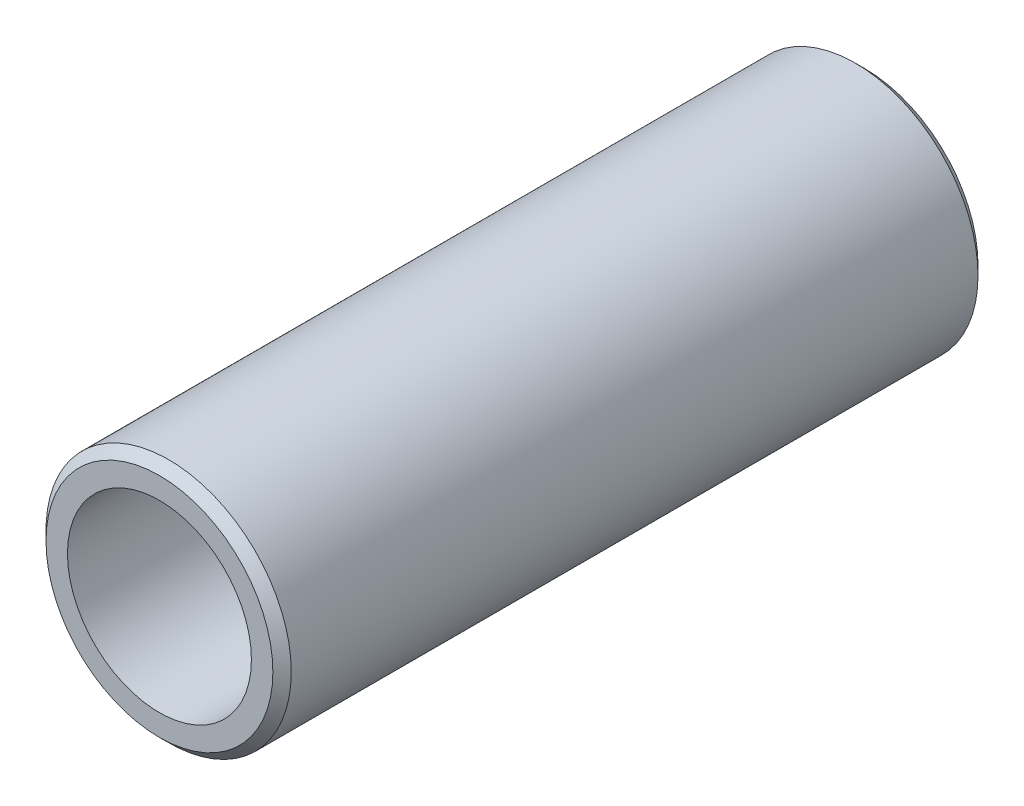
ISO-10303-21;
HEADER;
FILE_DESCRIPTION(('STEP AP214'),'2;1');
FILE_NAME('part.step','',(''),(''),'','','');
FILE_SCHEMA(('AUTOMOTIVE_DESIGN { 1 0 10303 214 1 1 1 1 }'));
ENDSEC;
DATA;
#1=APPLICATION_CONTEXT('core data for automotive mechanical design processes');
#2=APPLICATION_PROTOCOL_DEFINITION('international standard','automotive_design',2000,#1);
#3=PRODUCT_CONTEXT('',#1,'mechanical');
#4=PRODUCT('Part','Part','',(#3));
#5=PRODUCT_RELATED_PRODUCT_CATEGORY('part','',(#4));
#6=PRODUCT_DEFINITION_FORMATION('','',#4);
#7=PRODUCT_DEFINITION_CONTEXT('part definition',#1,'design');
#8=PRODUCT_DEFINITION('design','',#6,#7);
#9=PRODUCT_DEFINITION_SHAPE('','',#8);
#10=(LENGTH_UNIT() NAMED_UNIT(*) SI_UNIT(.MILLI.,.METRE.));
#11=(NAMED_UNIT(*) PLANE_ANGLE_UNIT() SI_UNIT($,.RADIAN.));
#12=(NAMED_UNIT(*) SI_UNIT($,.STERADIAN.) SOLID_ANGLE_UNIT());
#13=UNCERTAINTY_MEASURE_WITH_UNIT(LENGTH_MEASURE(1.E-05),#10,'distance_accuracy_value','');
#14=(GEOMETRIC_REPRESENTATION_CONTEXT(3) GLOBAL_UNCERTAINTY_ASSIGNED_CONTEXT((#13)) GLOBAL_UNIT_ASSIGNED_CONTEXT((#10,
#11,#12)) REPRESENTATION_CONTEXT('',''));
#15=CARTESIAN_POINT('',(0.,0.,0.));
#16=DIRECTION('',(0.,0.,1.));
#17=DIRECTION('',(1.,0.,0.));
#18=AXIS2_PLACEMENT_3D('',#15,#16,#17);
#19=CARTESIAN_POINT('',(0.,0.,-23.));
#20=DIRECTION('',(0.,0.,1.));
#21=DIRECTION('',(1.,0.,0.));
#22=AXIS2_PLACEMENT_3D('',#19,#20,#21);
#23=CYLINDRICAL_SURFACE('',#22,4.);
#24=CARTESIAN_POINT('',(0.,0.,-0.300000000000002));
#25=DIRECTION('',(0.,0.,1.));
#26=DIRECTION('',(1.,0.,0.));
#27=AXIS2_PLACEMENT_3D('',#24,#25,#26);
#28=CIRCLE('',#27,4.);
#29=CARTESIAN_POINT('',(4.,0.,-0.300000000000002));
#30=VERTEX_POINT('',#29);
#31=EDGE_CURVE('E32',#30,#30,#28,.F.);
#32=ORIENTED_EDGE('',*,*,#31,.T.);
#33=EDGE_LOOP('',(#32));
#34=FACE_BOUND('',#33,.T.);
#35=CARTESIAN_POINT('',(0.,0.,-22.7));
#36=DIRECTION('',(0.,0.,1.));
#37=DIRECTION('',(1.,0.,0.));
#38=AXIS2_PLACEMENT_3D('',#35,#36,#37);
#39=CIRCLE('',#38,4.);
#40=CARTESIAN_POINT('',(4.,0.,-22.7));
#41=VERTEX_POINT('',#40);
#42=EDGE_CURVE('E36',#41,#41,#39,.T.);
#43=ORIENTED_EDGE('',*,*,#42,.T.);
#44=EDGE_LOOP('',(#43));
#45=FACE_BOUND('',#44,.T.);
#46=ADVANCED_FACE('F26',(#34,#45),#23,.T.);
#47=CARTESIAN_POINT('',(0.,0.,-23.));
#48=DIRECTION('',(0.,0.,1.));
#49=DIRECTION('',(1.,0.,0.));
#50=AXIS2_PLACEMENT_3D('',#47,#48,#49);
#51=PLANE('',#50);
#52=CARTESIAN_POINT('',(0.,0.,-23.));
#53=DIRECTION('',(0.,0.,1.));
#54=DIRECTION('',(1.,0.,0.));
#55=AXIS2_PLACEMENT_3D('',#52,#53,#54);
#56=CIRCLE('',#55,3.7);
#57=CARTESIAN_POINT('',(3.7,0.,-23.));
#58=VERTEX_POINT('',#57);
#59=EDGE_CURVE('E10',#58,#58,#56,.F.);
#60=ORIENTED_EDGE('',*,*,#59,.T.);
#61=EDGE_LOOP('',(#60));
#62=FACE_BOUND('',#61,.T.);
#63=CARTESIAN_POINT('',(0.,0.,-23.));
#64=DIRECTION('',(0.,0.,1.));
#65=DIRECTION('',(1.,0.,0.));
#66=AXIS2_PLACEMENT_3D('',#63,#64,#65);
#67=CIRCLE('',#66,3.);
#68=CARTESIAN_POINT('',(3.,0.,-23.));
#69=VERTEX_POINT('',#68);
#70=EDGE_CURVE('E45',#69,#69,#67,.T.);
#71=ORIENTED_EDGE('',*,*,#70,.T.);
#72=EDGE_LOOP('',(#71));
#73=FACE_BOUND('',#72,.T.);
#74=ADVANCED_FACE('F56',(#62,#73),#51,.F.);
#75=CARTESIAN_POINT('',(0.,0.,0.));
#76=DIRECTION('',(0.,0.,1.));
#77=DIRECTION('',(1.,0.,0.));
#78=AXIS2_PLACEMENT_3D('',#75,#76,#77);
#79=PLANE('',#78);
#80=CARTESIAN_POINT('',(0.,0.,0.));
#81=DIRECTION('',(0.,0.,1.));
#82=DIRECTION('',(1.,0.,0.));
#83=AXIS2_PLACEMENT_3D('',#80,#81,#82);
#84=CIRCLE('',#83,3.7);
#85=CARTESIAN_POINT('',(3.7,0.,0.));
#86=VERTEX_POINT('',#85);
#87=EDGE_CURVE('E40',#86,#86,#84,.T.);
#88=ORIENTED_EDGE('',*,*,#87,.T.);
#89=EDGE_LOOP('',(#88));
#90=FACE_BOUND('',#89,.T.);
#91=CARTESIAN_POINT('',(0.,0.,0.));
#92=DIRECTION('',(0.,0.,1.));
#93=DIRECTION('',(1.,0.,0.));
#94=AXIS2_PLACEMENT_3D('',#91,#92,#93);
#95=CIRCLE('',#94,3.);
#96=CARTESIAN_POINT('',(3.,0.,0.));
#97=VERTEX_POINT('',#96);
#98=EDGE_CURVE('E48',#97,#97,#95,.T.);
#99=ORIENTED_EDGE('',*,*,#98,.F.);
#100=EDGE_LOOP('',(#99));
#101=FACE_BOUND('',#100,.T.);
#102=ADVANCED_FACE('F54',(#90,#101),#79,.T.);
#103=CARTESIAN_POINT('',(0.,0.,-23.));
#104=DIRECTION('',(0.,0.,1.));
#105=DIRECTION('',(1.,0.,0.));
#106=AXIS2_PLACEMENT_3D('',#103,#104,#105);
#107=CYLINDRICAL_SURFACE('',#106,3.);
#108=ORIENTED_EDGE('',*,*,#70,.F.);
#109=EDGE_LOOP('',(#108));
#110=FACE_BOUND('',#109,.T.);
#111=ORIENTED_EDGE('',*,*,#98,.T.);
#112=EDGE_LOOP('',(#111));
#113=FACE_BOUND('',#112,.T.);
#114=ADVANCED_FACE('F52',(#110,#113),#107,.F.);
#115=CARTESIAN_POINT('',(0.,0.,0.));
#116=DIRECTION('',(0.,0.,-1.));
#117=DIRECTION('',(-1.,0.,0.));
#118=AXIS2_PLACEMENT_3D('',#115,#116,#117);
#119=CONICAL_SURFACE('',#118,3.7,0.785398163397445);
#120=ORIENTED_EDGE('',*,*,#31,.F.);
#121=EDGE_LOOP('',(#120));
#122=FACE_BOUND('',#121,.T.);
#123=ORIENTED_EDGE('',*,*,#87,.F.);
#124=EDGE_LOOP('',(#123));
#125=FACE_BOUND('',#124,.T.);
#126=ADVANCED_FACE('F63',(#122,#125),#119,.T.);
#127=CARTESIAN_POINT('',(0.,0.,-22.7));
#128=DIRECTION('',(0.,0.,1.));
#129=DIRECTION('',(1.,0.,0.));
#130=AXIS2_PLACEMENT_3D('',#127,#128,#129);
#131=CONICAL_SURFACE('',#130,4.,0.785398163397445);
#132=ORIENTED_EDGE('',*,*,#59,.F.);
#133=EDGE_LOOP('',(#132));
#134=FACE_BOUND('',#133,.T.);
#135=ORIENTED_EDGE('',*,*,#42,.F.);
#136=EDGE_LOOP('',(#135));
#137=FACE_BOUND('',#136,.T.);
#138=ADVANCED_FACE('F72',(#134,#137),#131,.T.);
#139=CLOSED_SHELL('',(#46,#74,#102,#114,#126,#138));
#140=MANIFOLD_SOLID_BREP('B2',#139);
#141=ADVANCED_BREP_SHAPE_REPRESENTATION('',(#18,#140),#14);
#142=SHAPE_DEFINITION_REPRESENTATION(#9,#141);
ENDSEC;
END-ISO-10303-21;
